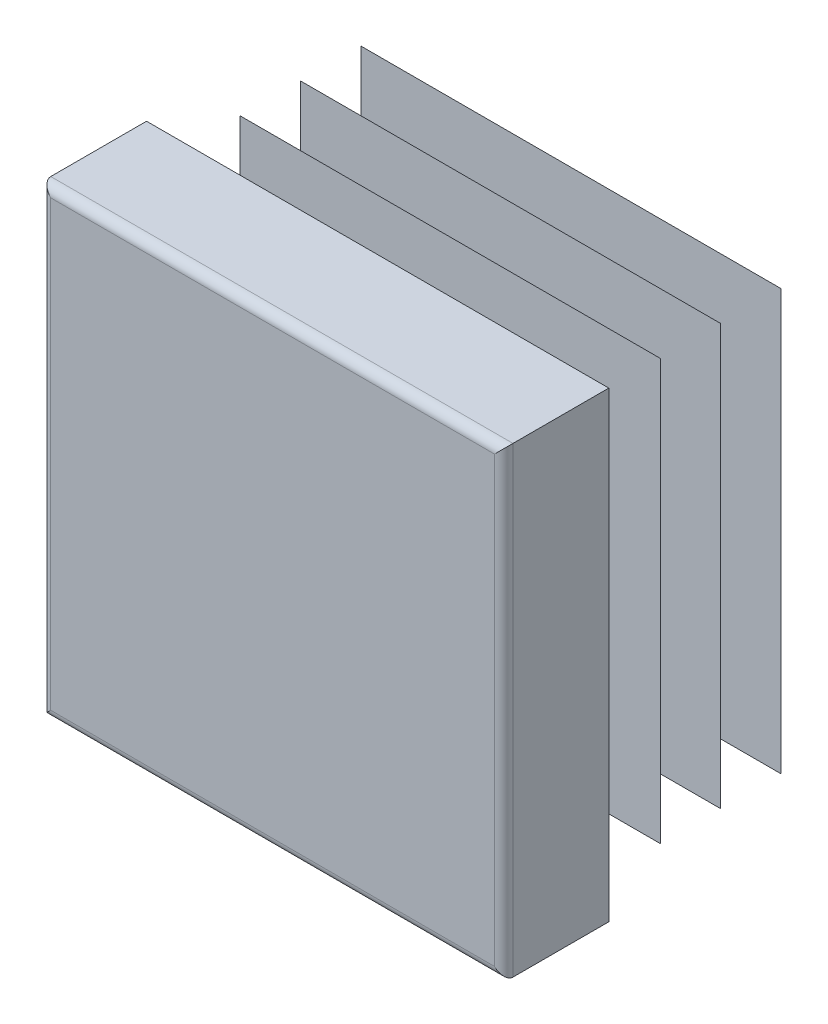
ISO-10303-21;
HEADER;
FILE_DESCRIPTION(('STEP AP214'),'2;1');
FILE_NAME('part.step','',(''),(''),'','','');
FILE_SCHEMA(('AUTOMOTIVE_DESIGN { 1 0 10303 214 1 1 1 1 }'));
ENDSEC;
DATA;
#1=APPLICATION_CONTEXT('core data for automotive mechanical design processes');
#2=APPLICATION_PROTOCOL_DEFINITION('international standard','automotive_design',2000,#1);
#3=PRODUCT_CONTEXT('',#1,'mechanical');
#4=PRODUCT('Part','Part','',(#3));
#5=PRODUCT_RELATED_PRODUCT_CATEGORY('part','',(#4));
#6=PRODUCT_DEFINITION_FORMATION('','',#4);
#7=PRODUCT_DEFINITION_CONTEXT('part definition',#1,'design');
#8=PRODUCT_DEFINITION('design','',#6,#7);
#9=PRODUCT_DEFINITION_SHAPE('','',#8);
#10=(LENGTH_UNIT() NAMED_UNIT(*) SI_UNIT(.MILLI.,.METRE.));
#11=(NAMED_UNIT(*) PLANE_ANGLE_UNIT() SI_UNIT($,.RADIAN.));
#12=(NAMED_UNIT(*) SI_UNIT($,.STERADIAN.) SOLID_ANGLE_UNIT());
#13=UNCERTAINTY_MEASURE_WITH_UNIT(LENGTH_MEASURE(1.E-05),#10,'distance_accuracy_value','');
#14=(GEOMETRIC_REPRESENTATION_CONTEXT(3) GLOBAL_UNCERTAINTY_ASSIGNED_CONTEXT((#13)) GLOBAL_UNIT_ASSIGNED_CONTEXT((#10,
#11,#12)) REPRESENTATION_CONTEXT('',''));
#15=CARTESIAN_POINT('',(0.,0.,0.));
#16=DIRECTION('',(0.,0.,1.));
#17=DIRECTION('',(1.,0.,0.));
#18=AXIS2_PLACEMENT_3D('',#15,#16,#17);
#19=CARTESIAN_POINT('',(10.56,-11.,5.));
#20=DIRECTION('',(0.,0.,-1.));
#21=DIRECTION('',(0.,1.,0.));
#22=AXIS2_PLACEMENT_3D('',#19,#20,#21);
#23=PLANE('',#22);
#24=DIRECTION('',(0.,1.,0.));
#25=VECTOR('',#24,1.);
#26=CARTESIAN_POINT('',(-10.56,-11.,5.));
#27=LINE('',#26,#25);
#28=CARTESIAN_POINT('',(-10.56,-10.56,5.));
#29=VERTEX_POINT('',#28);
#30=CARTESIAN_POINT('',(-10.56,10.56,5.));
#31=VERTEX_POINT('',#30);
#32=EDGE_CURVE('E262',#29,#31,#27,.T.);
#33=ORIENTED_EDGE('',*,*,#32,.F.);
#34=DIRECTION('',(-1.,0.,0.));
#35=VECTOR('',#34,1.);
#36=CARTESIAN_POINT('',(11.,-10.56,5.));
#37=LINE('',#36,#35);
#38=CARTESIAN_POINT('',(10.56,-10.56,5.));
#39=VERTEX_POINT('',#38);
#40=EDGE_CURVE('E432',#39,#29,#37,.T.);
#41=ORIENTED_EDGE('',*,*,#40,.F.);
#42=DIRECTION('',(0.,1.,0.));
#43=VECTOR('',#42,1.);
#44=CARTESIAN_POINT('',(10.56,-11.,5.));
#45=LINE('',#44,#43);
#46=CARTESIAN_POINT('',(10.56,10.56,5.));
#47=VERTEX_POINT('',#46);
#48=EDGE_CURVE('E257',#39,#47,#45,.T.);
#49=ORIENTED_EDGE('',*,*,#48,.T.);
#50=DIRECTION('',(-1.,0.,0.));
#51=VECTOR('',#50,1.);
#52=CARTESIAN_POINT('',(11.,10.56,5.));
#53=LINE('',#52,#51);
#54=EDGE_CURVE('E534',#47,#31,#53,.T.);
#55=ORIENTED_EDGE('',*,*,#54,.T.);
#56=EDGE_LOOP('',(#33,#41,#49,#55));
#57=FACE_BOUND('',#56,.T.);
#58=ADVANCED_FACE('F14',(#57),#23,.F.);
#59=CARTESIAN_POINT('',(-10.56,-11.,4.56));
#60=DIRECTION('',(0.,1.,0.));
#61=DIRECTION('',(-1.,0.,0.));
#62=AXIS2_PLACEMENT_3D('',#59,#60,#61);
#63=CYLINDRICAL_SURFACE('',#62,0.44);
#64=DIRECTION('',(0.,1.,0.));
#65=VECTOR('',#64,1.);
#66=CARTESIAN_POINT('',(-11.,-11.,4.56));
#67=LINE('',#66,#65);
#68=CARTESIAN_POINT('',(-11.,-11.,4.56));
#69=VERTEX_POINT('',#68);
#70=CARTESIAN_POINT('',(-11.,11.,4.56));
#71=VERTEX_POINT('',#70);
#72=EDGE_CURVE('E354',#69,#71,#67,.T.);
#73=ORIENTED_EDGE('',*,*,#72,.F.);
#74=CARTESIAN_POINT('',(-10.56,-10.56,4.56));
#75=DIRECTION('',(-0.707106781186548,0.707106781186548,0.));
#76=DIRECTION('',(0.707106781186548,0.707106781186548,0.));
#77=AXIS2_PLACEMENT_3D('',#74,#75,#76);
#78=ELLIPSE('',#77,0.622253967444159,0.44);
#79=EDGE_CURVE('E59',#69,#29,#78,.T.);
#80=ORIENTED_EDGE('',*,*,#79,.T.);
#81=ORIENTED_EDGE('',*,*,#32,.T.);
#82=CARTESIAN_POINT('',(-10.56,10.56,4.56));
#83=DIRECTION('',(0.707106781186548,0.707106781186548,0.));
#84=DIRECTION('',(-0.707106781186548,0.707106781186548,0.));
#85=AXIS2_PLACEMENT_3D('',#82,#83,#84);
#86=ELLIPSE('',#85,0.62225396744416,0.44);
#87=EDGE_CURVE('E258',#31,#71,#86,.F.);
#88=ORIENTED_EDGE('',*,*,#87,.T.);
#89=EDGE_LOOP('',(#73,#80,#81,#88));
#90=FACE_BOUND('',#89,.T.);
#91=ADVANCED_FACE('F16',(#90),#63,.T.);
#92=CARTESIAN_POINT('',(-11.,-11.,4.56));
#93=DIRECTION('',(1.,0.,0.));
#94=DIRECTION('',(0.,1.,0.));
#95=AXIS2_PLACEMENT_3D('',#92,#93,#94);
#96=PLANE('',#95);
#97=DIRECTION('',(0.,0.,-1.));
#98=VECTOR('',#97,1.);
#99=CARTESIAN_POINT('',(-11.,11.,4.56));
#100=LINE('',#99,#98);
#101=CARTESIAN_POINT('',(-11.,11.,0.));
#102=VERTEX_POINT('',#101);
#103=EDGE_CURVE('E519',#71,#102,#100,.T.);
#104=ORIENTED_EDGE('',*,*,#103,.T.);
#105=DIRECTION('',(0.,1.,0.));
#106=VECTOR('',#105,1.);
#107=CARTESIAN_POINT('',(-11.,-11.,0.));
#108=LINE('',#107,#106);
#109=CARTESIAN_POINT('',(-11.,-11.,0.));
#110=VERTEX_POINT('',#109);
#111=EDGE_CURVE('E352',#110,#102,#108,.T.);
#112=ORIENTED_EDGE('',*,*,#111,.F.);
#113=DIRECTION('',(0.,0.,-1.));
#114=VECTOR('',#113,1.);
#115=CARTESIAN_POINT('',(-11.,-11.,4.56));
#116=LINE('',#115,#114);
#117=EDGE_CURVE('E520',#69,#110,#116,.T.);
#118=ORIENTED_EDGE('',*,*,#117,.F.);
#119=ORIENTED_EDGE('',*,*,#72,.T.);
#120=EDGE_LOOP('',(#104,#112,#118,#119));
#121=FACE_BOUND('',#120,.T.);
#122=ADVANCED_FACE('F604',(#121),#96,.F.);
#123=CARTESIAN_POINT('',(-7.,-11.,0.));
#124=DIRECTION('',(1.,0.,0.));
#125=DIRECTION('',(0.,1.,0.));
#126=AXIS2_PLACEMENT_3D('',#123,#124,#125);
#127=PLANE('',#126);
#128=DIRECTION('',(0.,1.,0.));
#129=VECTOR('',#128,1.);
#130=CARTESIAN_POINT('',(-7.,-11.,0.));
#131=LINE('',#130,#129);
#132=CARTESIAN_POINT('',(-7.,-7.,0.));
#133=VERTEX_POINT('',#132);
#134=CARTESIAN_POINT('',(-7.,7.,0.));
#135=VERTEX_POINT('',#134);
#136=EDGE_CURVE('E349',#133,#135,#131,.T.);
#137=ORIENTED_EDGE('',*,*,#136,.T.);
#138=DIRECTION('',(0.,0.,-1.));
#139=VECTOR('',#138,1.);
#140=CARTESIAN_POINT('',(-7.,7.,0.));
#141=LINE('',#140,#139);
#142=CARTESIAN_POINT('',(-7.,7.,-0.575));
#143=VERTEX_POINT('',#142);
#144=EDGE_CURVE('E445',#135,#143,#141,.T.);
#145=ORIENTED_EDGE('',*,*,#144,.T.);
#146=DIRECTION('',(0.,1.,0.));
#147=VECTOR('',#146,1.);
#148=CARTESIAN_POINT('',(-7.,-11.,-0.575));
#149=LINE('',#148,#147);
#150=CARTESIAN_POINT('',(-7.,-7.,-0.575));
#151=VERTEX_POINT('',#150);
#152=EDGE_CURVE('E346',#151,#143,#149,.T.);
#153=ORIENTED_EDGE('',*,*,#152,.F.);
#154=DIRECTION('',(0.,0.,1.));
#155=VECTOR('',#154,1.);
#156=CARTESIAN_POINT('',(-7.,-7.,0.));
#157=LINE('',#156,#155);
#158=EDGE_CURVE('E439',#151,#133,#157,.T.);
#159=ORIENTED_EDGE('',*,*,#158,.T.);
#160=EDGE_LOOP('',(#137,#145,#153,#159));
#161=FACE_BOUND('',#160,.T.);
#162=ADVANCED_FACE('F728',(#161),#127,.F.);
#163=CARTESIAN_POINT('',(-10.,-11.,-0.575));
#164=DIRECTION('',(0.573576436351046,0.,0.819152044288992));
#165=DIRECTION('',(-0.819152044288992,0.,0.573576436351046));
#166=AXIS2_PLACEMENT_3D('',#163,#164,#165);
#167=PLANE('',#166);
#168=DIRECTION('',(0.,1.,0.));
#169=VECTOR('',#168,1.);
#170=CARTESIAN_POINT('',(-10.,-11.,-0.575));
#171=LINE('',#170,#169);
#172=CARTESIAN_POINT('',(-10.,-10.,-0.575));
#173=VERTEX_POINT('',#172);
#174=CARTESIAN_POINT('',(-10.,10.,-0.575));
#175=VERTEX_POINT('',#174);
#176=EDGE_CURVE('E344',#173,#175,#171,.T.);
#177=ORIENTED_EDGE('',*,*,#176,.T.);
#178=DIRECTION('',(0.633687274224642,-0.633687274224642,-0.443712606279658));
#179=VECTOR('',#178,1.);
#180=CARTESIAN_POINT('',(-1.56724920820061,1.56724920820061,-6.47967567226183));
#181=LINE('',#180,#179);
#182=CARTESIAN_POINT('',(-7.,7.,-2.67562261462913));
#183=VERTEX_POINT('',#182);
#184=EDGE_CURVE('E457',#175,#183,#181,.T.);
#185=ORIENTED_EDGE('',*,*,#184,.T.);
#186=DIRECTION('',(0.,1.,0.));
#187=VECTOR('',#186,1.);
#188=CARTESIAN_POINT('',(-7.,-11.,-2.67562261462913));
#189=LINE('',#188,#187);
#190=CARTESIAN_POINT('',(-7.,-7.,-2.67562261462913));
#191=VERTEX_POINT('',#190);
#192=EDGE_CURVE('E341',#191,#183,#189,.T.);
#193=ORIENTED_EDGE('',*,*,#192,.F.);
#194=DIRECTION('',(-0.633687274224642,-0.633687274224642,0.443712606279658));
#195=VECTOR('',#194,1.);
#196=CARTESIAN_POINT('',(-10.4015595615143,-10.4015595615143,-0.293824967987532));
#197=LINE('',#196,#195);
#198=EDGE_CURVE('E451',#191,#173,#197,.T.);
#199=ORIENTED_EDGE('',*,*,#198,.T.);
#200=EDGE_LOOP('',(#177,#185,#193,#199));
#201=FACE_BOUND('',#200,.T.);
#202=ADVANCED_FACE('F732',(#201),#167,.F.);
#203=CARTESIAN_POINT('',(-7.,-11.,-2.67562261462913));
#204=DIRECTION('',(1.,0.,0.));
#205=DIRECTION('',(0.,1.,0.));
#206=AXIS2_PLACEMENT_3D('',#203,#204,#205);
#207=PLANE('',#206);
#208=ORIENTED_EDGE('',*,*,#192,.T.);
#209=DIRECTION('',(0.,0.,-1.));
#210=VECTOR('',#209,1.);
#211=CARTESIAN_POINT('',(-7.,7.,-2.67562261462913));
#212=LINE('',#211,#210);
#213=CARTESIAN_POINT('',(-7.,7.,-3.45));
#214=VERTEX_POINT('',#213);
#215=EDGE_CURVE('E463',#183,#214,#212,.T.);
#216=ORIENTED_EDGE('',*,*,#215,.T.);
#217=DIRECTION('',(0.,1.,0.));
#218=VECTOR('',#217,1.);
#219=CARTESIAN_POINT('',(-7.,-11.,-3.45));
#220=LINE('',#219,#218);
#221=CARTESIAN_POINT('',(-7.,-7.,-3.45));
#222=VERTEX_POINT('',#221);
#223=EDGE_CURVE('E338',#222,#214,#220,.T.);
#224=ORIENTED_EDGE('',*,*,#223,.F.);
#225=DIRECTION('',(0.,0.,1.));
#226=VECTOR('',#225,1.);
#227=CARTESIAN_POINT('',(-7.,-7.,-2.67562261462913));
#228=LINE('',#227,#226);
#229=EDGE_CURVE('E460',#222,#191,#228,.T.);
#230=ORIENTED_EDGE('',*,*,#229,.T.);
#231=EDGE_LOOP('',(#208,#216,#224,#230));
#232=FACE_BOUND('',#231,.T.);
#233=ADVANCED_FACE('F738',(#232),#207,.F.);
#234=CARTESIAN_POINT('',(-10.,-11.,-3.45));
#235=DIRECTION('',(0.573576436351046,0.,0.819152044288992));
#236=DIRECTION('',(-0.819152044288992,0.,0.573576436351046));
#237=AXIS2_PLACEMENT_3D('',#234,#235,#236);
#238=PLANE('',#237);
#239=DIRECTION('',(0.,1.,0.));
#240=VECTOR('',#239,1.);
#241=CARTESIAN_POINT('',(-10.,-11.,-3.45));
#242=LINE('',#241,#240);
#243=CARTESIAN_POINT('',(-10.,-10.,-3.45));
#244=VERTEX_POINT('',#243);
#245=CARTESIAN_POINT('',(-10.,10.,-3.45));
#246=VERTEX_POINT('',#245);
#247=EDGE_CURVE('E336',#244,#246,#242,.T.);
#248=ORIENTED_EDGE('',*,*,#247,.T.);
#249=DIRECTION('',(0.633687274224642,-0.633687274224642,-0.443712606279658));
#250=VECTOR('',#249,1.);
#251=CARTESIAN_POINT('',(-1.56724920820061,1.5672492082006,-9.35467567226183));
#252=LINE('',#251,#250);
#253=CARTESIAN_POINT('',(-7.,7.,-5.55062261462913));
#254=VERTEX_POINT('',#253);
#255=EDGE_CURVE('E475',#246,#254,#252,.T.);
#256=ORIENTED_EDGE('',*,*,#255,.T.);
#257=DIRECTION('',(0.,1.,0.));
#258=VECTOR('',#257,1.);
#259=CARTESIAN_POINT('',(-7.,-11.,-5.55062261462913));
#260=LINE('',#259,#258);
#261=CARTESIAN_POINT('',(-7.,-7.,-5.55062261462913));
#262=VERTEX_POINT('',#261);
#263=EDGE_CURVE('E333',#262,#254,#260,.T.);
#264=ORIENTED_EDGE('',*,*,#263,.F.);
#265=DIRECTION('',(-0.633687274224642,-0.633687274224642,0.443712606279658));
#266=VECTOR('',#265,1.);
#267=CARTESIAN_POINT('',(-10.4015595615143,-10.4015595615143,-3.16882496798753));
#268=LINE('',#267,#266);
#269=EDGE_CURVE('E469',#262,#244,#268,.T.);
#270=ORIENTED_EDGE('',*,*,#269,.T.);
#271=EDGE_LOOP('',(#248,#256,#264,#270));
#272=FACE_BOUND('',#271,.T.);
#273=ADVANCED_FACE('F742',(#272),#238,.F.);
#274=CARTESIAN_POINT('',(-7.,-11.,-5.55062261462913));
#275=DIRECTION('',(1.,0.,0.));
#276=DIRECTION('',(0.,1.,0.));
#277=AXIS2_PLACEMENT_3D('',#274,#275,#276);
#278=PLANE('',#277);
#279=ORIENTED_EDGE('',*,*,#263,.T.);
#280=DIRECTION('',(0.,0.,-1.));
#281=VECTOR('',#280,1.);
#282=CARTESIAN_POINT('',(-7.,7.,-5.55062261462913));
#283=LINE('',#282,#281);
#284=CARTESIAN_POINT('',(-7.,7.,-6.325));
#285=VERTEX_POINT('',#284);
#286=EDGE_CURVE('E481',#254,#285,#283,.T.);
#287=ORIENTED_EDGE('',*,*,#286,.T.);
#288=DIRECTION('',(0.,1.,0.));
#289=VECTOR('',#288,1.);
#290=CARTESIAN_POINT('',(-7.,-11.,-6.325));
#291=LINE('',#290,#289);
#292=CARTESIAN_POINT('',(-7.,-7.,-6.325));
#293=VERTEX_POINT('',#292);
#294=EDGE_CURVE('E330',#293,#285,#291,.T.);
#295=ORIENTED_EDGE('',*,*,#294,.F.);
#296=DIRECTION('',(0.,0.,1.));
#297=VECTOR('',#296,1.);
#298=CARTESIAN_POINT('',(-7.,-7.,-5.55062261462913));
#299=LINE('',#298,#297);
#300=EDGE_CURVE('E478',#293,#262,#299,.T.);
#301=ORIENTED_EDGE('',*,*,#300,.T.);
#302=EDGE_LOOP('',(#279,#287,#295,#301));
#303=FACE_BOUND('',#302,.T.);
#304=ADVANCED_FACE('F746',(#303),#278,.F.);
#305=CARTESIAN_POINT('',(-10.,-11.,-6.325));
#306=DIRECTION('',(0.573576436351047,0.,0.819152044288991));
#307=DIRECTION('',(-0.819152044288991,0.,0.573576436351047));
#308=AXIS2_PLACEMENT_3D('',#305,#306,#307);
#309=PLANE('',#308);
#310=DIRECTION('',(0.,1.,0.));
#311=VECTOR('',#310,1.);
#312=CARTESIAN_POINT('',(-10.,-11.,-6.325));
#313=LINE('',#312,#311);
#314=CARTESIAN_POINT('',(-10.,-10.,-6.325));
#315=VERTEX_POINT('',#314);
#316=CARTESIAN_POINT('',(-10.,10.,-6.325));
#317=VERTEX_POINT('',#316);
#318=EDGE_CURVE('E328',#315,#317,#313,.T.);
#319=ORIENTED_EDGE('',*,*,#318,.T.);
#320=DIRECTION('',(0.633687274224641,-0.633687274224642,-0.443712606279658));
#321=VECTOR('',#320,1.);
#322=CARTESIAN_POINT('',(-1.56724920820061,1.5672492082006,-12.2296756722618));
#323=LINE('',#322,#321);
#324=CARTESIAN_POINT('',(-7.,7.,-8.42562261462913));
#325=VERTEX_POINT('',#324);
#326=EDGE_CURVE('E493',#317,#325,#323,.T.);
#327=ORIENTED_EDGE('',*,*,#326,.T.);
#328=DIRECTION('',(0.,1.,0.));
#329=VECTOR('',#328,1.);
#330=CARTESIAN_POINT('',(-7.,-11.,-8.42562261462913));
#331=LINE('',#330,#329);
#332=CARTESIAN_POINT('',(-7.,-7.,-8.42562261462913));
#333=VERTEX_POINT('',#332);
#334=EDGE_CURVE('E325',#333,#325,#331,.T.);
#335=ORIENTED_EDGE('',*,*,#334,.F.);
#336=DIRECTION('',(-0.633687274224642,-0.633687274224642,0.443712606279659));
#337=VECTOR('',#336,1.);
#338=CARTESIAN_POINT('',(-10.4015595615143,-10.4015595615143,-6.04382496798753));
#339=LINE('',#338,#337);
#340=EDGE_CURVE('E487',#333,#315,#339,.T.);
#341=ORIENTED_EDGE('',*,*,#340,.T.);
#342=EDGE_LOOP('',(#319,#327,#335,#341));
#343=FACE_BOUND('',#342,.T.);
#344=ADVANCED_FACE('F668',(#343),#309,.F.);
#345=CARTESIAN_POINT('',(-7.,-11.,-8.42562261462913));
#346=DIRECTION('',(1.,0.,0.));
#347=DIRECTION('',(0.,1.,0.));
#348=AXIS2_PLACEMENT_3D('',#345,#346,#347);
#349=PLANE('',#348);
#350=ORIENTED_EDGE('',*,*,#334,.T.);
#351=DIRECTION('',(0.,0.,-1.));
#352=VECTOR('',#351,1.);
#353=CARTESIAN_POINT('',(-7.,7.,-8.42562261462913));
#354=LINE('',#353,#352);
#355=CARTESIAN_POINT('',(-7.,7.,-9.2));
#356=VERTEX_POINT('',#355);
#357=EDGE_CURVE('E499',#325,#356,#354,.T.);
#358=ORIENTED_EDGE('',*,*,#357,.T.);
#359=DIRECTION('',(0.,1.,0.));
#360=VECTOR('',#359,1.);
#361=CARTESIAN_POINT('',(-7.,-11.,-9.2));
#362=LINE('',#361,#360);
#363=CARTESIAN_POINT('',(-7.,-7.,-9.2));
#364=VERTEX_POINT('',#363);
#365=EDGE_CURVE('E322',#364,#356,#362,.T.);
#366=ORIENTED_EDGE('',*,*,#365,.F.);
#367=DIRECTION('',(0.,0.,1.));
#368=VECTOR('',#367,1.);
#369=CARTESIAN_POINT('',(-7.,-7.,-8.42562261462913));
#370=LINE('',#369,#368);
#371=EDGE_CURVE('E496',#364,#333,#370,.T.);
#372=ORIENTED_EDGE('',*,*,#371,.T.);
#373=EDGE_LOOP('',(#350,#358,#366,#372));
#374=FACE_BOUND('',#373,.T.);
#375=ADVANCED_FACE('F665',(#374),#349,.F.);
#376=CARTESIAN_POINT('',(-10.,-11.,-9.2));
#377=DIRECTION('',(0.573576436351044,0.,0.819152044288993));
#378=DIRECTION('',(-0.819152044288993,0.,0.573576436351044));
#379=AXIS2_PLACEMENT_3D('',#376,#377,#378);
#380=PLANE('',#379);
#381=DIRECTION('',(0.,1.,0.));
#382=VECTOR('',#381,1.);
#383=CARTESIAN_POINT('',(-10.,-11.,-9.2));
#384=LINE('',#383,#382);
#385=CARTESIAN_POINT('',(-10.,-10.,-9.2));
#386=VERTEX_POINT('',#385);
#387=CARTESIAN_POINT('',(-10.,10.,-9.2));
#388=VERTEX_POINT('',#387);
#389=EDGE_CURVE('E320',#386,#388,#384,.T.);
#390=ORIENTED_EDGE('',*,*,#389,.T.);
#391=DIRECTION('',(0.633687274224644,-0.633687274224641,-0.443712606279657));
#392=VECTOR('',#391,1.);
#393=CARTESIAN_POINT('',(-1.5672492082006,1.56724920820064,-15.1046756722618));
#394=LINE('',#393,#392);
#395=CARTESIAN_POINT('',(-7.,7.,-11.3006226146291));
#396=VERTEX_POINT('',#395);
#397=EDGE_CURVE('E511',#388,#396,#394,.T.);
#398=ORIENTED_EDGE('',*,*,#397,.T.);
#399=DIRECTION('',(0.,1.,0.));
#400=VECTOR('',#399,1.);
#401=CARTESIAN_POINT('',(-7.,-11.,-11.3006226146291));
#402=LINE('',#401,#400);
#403=CARTESIAN_POINT('',(-7.,-7.,-11.3006226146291));
#404=VERTEX_POINT('',#403);
#405=EDGE_CURVE('E317',#404,#396,#402,.T.);
#406=ORIENTED_EDGE('',*,*,#405,.F.);
#407=DIRECTION('',(-0.633687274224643,-0.633687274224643,0.443712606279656));
#408=VECTOR('',#407,1.);
#409=CARTESIAN_POINT('',(-10.4015595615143,-10.4015595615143,-8.91882496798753));
#410=LINE('',#409,#408);
#411=EDGE_CURVE('E505',#404,#386,#410,.T.);
#412=ORIENTED_EDGE('',*,*,#411,.T.);
#413=EDGE_LOOP('',(#390,#398,#406,#412));
#414=FACE_BOUND('',#413,.T.);
#415=ADVANCED_FACE('F580',(#414),#380,.F.);
#416=CARTESIAN_POINT('',(-7.,-11.,-11.3006226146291));
#417=DIRECTION('',(1.,0.,0.));
#418=DIRECTION('',(0.,1.,0.));
#419=AXIS2_PLACEMENT_3D('',#416,#417,#418);
#420=PLANE('',#419);
#421=ORIENTED_EDGE('',*,*,#405,.T.);
#422=DIRECTION('',(0.,0.,-1.));
#423=VECTOR('',#422,1.);
#424=CARTESIAN_POINT('',(-7.,7.,-11.3006226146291));
#425=LINE('',#424,#423);
#426=CARTESIAN_POINT('',(-7.,7.,-11.5));
#427=VERTEX_POINT('',#426);
#428=EDGE_CURVE('E517',#396,#427,#425,.T.);
#429=ORIENTED_EDGE('',*,*,#428,.T.);
#430=DIRECTION('',(0.,1.,0.));
#431=VECTOR('',#430,1.);
#432=CARTESIAN_POINT('',(-7.,-11.,-11.5));
#433=LINE('',#432,#431);
#434=CARTESIAN_POINT('',(-7.,-7.,-11.5));
#435=VERTEX_POINT('',#434);
#436=EDGE_CURVE('E314',#435,#427,#433,.T.);
#437=ORIENTED_EDGE('',*,*,#436,.F.);
#438=DIRECTION('',(0.,0.,1.));
#439=VECTOR('',#438,1.);
#440=CARTESIAN_POINT('',(-7.,-7.,-11.3006226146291));
#441=LINE('',#440,#439);
#442=EDGE_CURVE('E514',#435,#404,#441,.T.);
#443=ORIENTED_EDGE('',*,*,#442,.T.);
#444=EDGE_LOOP('',(#421,#429,#437,#443));
#445=FACE_BOUND('',#444,.T.);
#446=ADVANCED_FACE('F582',(#445),#420,.F.);
#447=CARTESIAN_POINT('',(-7.,-11.,-11.5));
#448=DIRECTION('',(0.,0.,1.));
#449=DIRECTION('',(0.,-1.,0.));
#450=AXIS2_PLACEMENT_3D('',#447,#448,#449);
#451=PLANE('',#450);
#452=ORIENTED_EDGE('',*,*,#436,.T.);
#453=DIRECTION('',(-1.,0.,0.));
#454=VECTOR('',#453,1.);
#455=CARTESIAN_POINT('',(11.,7.,-11.5));
#456=LINE('',#455,#454);
#457=CARTESIAN_POINT('',(7.,7.,-11.5));
#458=VERTEX_POINT('',#457);
#459=EDGE_CURVE('E388',#458,#427,#456,.T.);
#460=ORIENTED_EDGE('',*,*,#459,.F.);
#461=DIRECTION('',(0.,1.,0.));
#462=VECTOR('',#461,1.);
#463=CARTESIAN_POINT('',(7.,-11.,-11.5));
#464=LINE('',#463,#462);
#465=CARTESIAN_POINT('',(7.,-7.,-11.5));
#466=VERTEX_POINT('',#465);
#467=EDGE_CURVE('E311',#466,#458,#464,.T.);
#468=ORIENTED_EDGE('',*,*,#467,.F.);
#469=DIRECTION('',(-1.,0.,0.));
#470=VECTOR('',#469,1.);
#471=CARTESIAN_POINT('',(11.,-7.,-11.5));
#472=LINE('',#471,#470);
#473=EDGE_CURVE('E386',#466,#435,#472,.T.);
#474=ORIENTED_EDGE('',*,*,#473,.T.);
#475=EDGE_LOOP('',(#452,#460,#468,#474));
#476=FACE_BOUND('',#475,.T.);
#477=ADVANCED_FACE('F385',(#476),#451,.F.);
#478=CARTESIAN_POINT('',(7.,-11.,-11.5));
#479=DIRECTION('',(-1.,0.,0.));
#480=DIRECTION('',(0.,-1.,0.));
#481=AXIS2_PLACEMENT_3D('',#478,#479,#480);
#482=PLANE('',#481);
#483=ORIENTED_EDGE('',*,*,#467,.T.);
#484=DIRECTION('',(0.,0.,1.));
#485=VECTOR('',#484,1.);
#486=CARTESIAN_POINT('',(7.,7.,-11.5));
#487=LINE('',#486,#485);
#488=CARTESIAN_POINT('',(7.,7.,-11.3006226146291));
#489=VERTEX_POINT('',#488);
#490=EDGE_CURVE('E9',#458,#489,#487,.T.);
#491=ORIENTED_EDGE('',*,*,#490,.T.);
#492=DIRECTION('',(0.,1.,0.));
#493=VECTOR('',#492,1.);
#494=CARTESIAN_POINT('',(7.,-11.,-11.3006226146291));
#495=LINE('',#494,#493);
#496=CARTESIAN_POINT('',(7.,-7.,-11.3006226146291));
#497=VERTEX_POINT('',#496);
#498=EDGE_CURVE('E308',#497,#489,#495,.T.);
#499=ORIENTED_EDGE('',*,*,#498,.F.);
#500=DIRECTION('',(0.,0.,-1.));
#501=VECTOR('',#500,1.);
#502=CARTESIAN_POINT('',(7.,-7.,-11.5));
#503=LINE('',#502,#501);
#504=EDGE_CURVE('E23',#497,#466,#503,.T.);
#505=ORIENTED_EDGE('',*,*,#504,.T.);
#506=EDGE_LOOP('',(#483,#491,#499,#505));
#507=FACE_BOUND('',#506,.T.);
#508=ADVANCED_FACE('F378',(#507),#482,.F.);
#509=CARTESIAN_POINT('',(7.,-11.,-11.3006226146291));
#510=DIRECTION('',(-0.573576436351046,0.,0.819152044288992));
#511=DIRECTION('',(-0.819152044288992,0.,-0.573576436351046));
#512=AXIS2_PLACEMENT_3D('',#509,#510,#511);
#513=PLANE('',#512);
#514=ORIENTED_EDGE('',*,*,#498,.T.);
#515=DIRECTION('',(0.633687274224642,0.633687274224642,0.443712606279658));
#516=VECTOR('',#515,1.);
#517=CARTESIAN_POINT('',(-0.22807210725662,-0.228072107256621,-16.3617731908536));
#518=LINE('',#517,#516);
#519=CARTESIAN_POINT('',(10.,10.,-9.2));
#520=VERTEX_POINT('',#519);
#521=EDGE_CURVE('E508',#489,#520,#518,.T.);
#522=ORIENTED_EDGE('',*,*,#521,.T.);
#523=DIRECTION('',(0.,1.,0.));
#524=VECTOR('',#523,1.);
#525=CARTESIAN_POINT('',(10.,-11.,-9.2));
#526=LINE('',#525,#524);
#527=CARTESIAN_POINT('',(10.,-10.,-9.2));
#528=VERTEX_POINT('',#527);
#529=EDGE_CURVE('E305',#528,#520,#526,.T.);
#530=ORIENTED_EDGE('',*,*,#529,.F.);
#531=DIRECTION('',(-0.633687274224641,0.633687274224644,-0.443712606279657));
#532=VECTOR('',#531,1.);
#533=CARTESIAN_POINT('',(8.60623824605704,-8.60623824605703,-10.1759224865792));
#534=LINE('',#533,#532);
#535=EDGE_CURVE('E502',#528,#497,#534,.T.);
#536=ORIENTED_EDGE('',*,*,#535,.T.);
#537=EDGE_LOOP('',(#514,#522,#530,#536));
#538=FACE_BOUND('',#537,.T.);
#539=ADVANCED_FACE('F588',(#538),#513,.F.);
#540=CARTESIAN_POINT('',(10.,-11.,-9.2));
#541=DIRECTION('',(0.,0.,-1.));
#542=DIRECTION('',(0.,1.,0.));
#543=AXIS2_PLACEMENT_3D('',#540,#541,#542);
#544=PLANE('',#543);
#545=ORIENTED_EDGE('',*,*,#529,.T.);
#546=DIRECTION('',(-1.,0.,0.));
#547=VECTOR('',#546,1.);
#548=CARTESIAN_POINT('',(11.,10.,-9.2));
#549=LINE('',#548,#547);
#550=EDGE_CURVE('E394',#520,#388,#549,.T.);
#551=ORIENTED_EDGE('',*,*,#550,.T.);
#552=ORIENTED_EDGE('',*,*,#389,.F.);
#553=DIRECTION('',(-1.,0.,0.));
#554=VECTOR('',#553,1.);
#555=CARTESIAN_POINT('',(11.,-10.,-9.2));
#556=LINE('',#555,#554);
#557=EDGE_CURVE('E401',#528,#386,#556,.T.);
#558=ORIENTED_EDGE('',*,*,#557,.F.);
#559=EDGE_LOOP('',(#545,#551,#552,#558));
#560=FACE_BOUND('',#559,.T.);
#561=ORIENTED_EDGE('',*,*,#365,.T.);
#562=DIRECTION('',(-1.,0.,0.));
#563=VECTOR('',#562,1.);
#564=CARTESIAN_POINT('',(11.,7.,-9.2));
#565=LINE('',#564,#563);
#566=CARTESIAN_POINT('',(7.,7.,-9.2));
#567=VERTEX_POINT('',#566);
#568=EDGE_CURVE('E567',#567,#356,#565,.T.);
#569=ORIENTED_EDGE('',*,*,#568,.F.);
#570=DIRECTION('',(0.,1.,0.));
#571=VECTOR('',#570,1.);
#572=CARTESIAN_POINT('',(7.,-11.,-9.2));
#573=LINE('',#572,#571);
#574=CARTESIAN_POINT('',(7.,-7.,-9.2));
#575=VERTEX_POINT('',#574);
#576=EDGE_CURVE('E302',#575,#567,#573,.T.);
#577=ORIENTED_EDGE('',*,*,#576,.F.);
#578=DIRECTION('',(-1.,0.,0.));
#579=VECTOR('',#578,1.);
#580=CARTESIAN_POINT('',(11.,-7.,-9.2));
#581=LINE('',#580,#579);
#582=EDGE_CURVE('E403',#575,#364,#581,.T.);
#583=ORIENTED_EDGE('',*,*,#582,.T.);
#584=EDGE_LOOP('',(#561,#569,#577,#583));
#585=FACE_BOUND('',#584,.T.);
#586=ADVANCED_FACE('F571',(#560,#585),#544,.F.);
#587=CARTESIAN_POINT('',(7.,-11.,-9.2));
#588=DIRECTION('',(-1.,0.,0.));
#589=DIRECTION('',(0.,-1.,0.));
#590=AXIS2_PLACEMENT_3D('',#587,#588,#589);
#591=PLANE('',#590);
#592=ORIENTED_EDGE('',*,*,#576,.T.);
#593=DIRECTION('',(0.,0.,1.));
#594=VECTOR('',#593,1.);
#595=CARTESIAN_POINT('',(7.,7.,-9.2));
#596=LINE('',#595,#594);
#597=CARTESIAN_POINT('',(7.,7.,-8.42562261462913));
#598=VERTEX_POINT('',#597);
#599=EDGE_CURVE('E372',#567,#598,#596,.T.);
#600=ORIENTED_EDGE('',*,*,#599,.T.);
#601=DIRECTION('',(0.,1.,0.));
#602=VECTOR('',#601,1.);
#603=CARTESIAN_POINT('',(7.,-11.,-8.42562261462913));
#604=LINE('',#603,#602);
#605=CARTESIAN_POINT('',(7.,-7.,-8.42562261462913));
#606=VERTEX_POINT('',#605);
#607=EDGE_CURVE('E299',#606,#598,#604,.T.);
#608=ORIENTED_EDGE('',*,*,#607,.F.);
#609=DIRECTION('',(0.,0.,-1.));
#610=VECTOR('',#609,1.);
#611=CARTESIAN_POINT('',(7.,-7.,-9.2));
#612=LINE('',#611,#610);
#613=EDGE_CURVE('E369',#606,#575,#612,.T.);
#614=ORIENTED_EDGE('',*,*,#613,.T.);
#615=EDGE_LOOP('',(#592,#600,#608,#614));
#616=FACE_BOUND('',#615,.T.);
#617=ADVANCED_FACE('F596',(#616),#591,.F.);
#618=CARTESIAN_POINT('',(7.,-11.,-8.42562261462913));
#619=DIRECTION('',(-0.573576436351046,0.,0.819152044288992));
#620=DIRECTION('',(-0.819152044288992,0.,-0.573576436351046));
#621=AXIS2_PLACEMENT_3D('',#618,#619,#620);
#622=PLANE('',#621);
#623=ORIENTED_EDGE('',*,*,#607,.T.);
#624=DIRECTION('',(0.633687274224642,0.633687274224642,0.443712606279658));
#625=VECTOR('',#624,1.);
#626=CARTESIAN_POINT('',(-0.228072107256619,-0.228072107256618,-13.4867731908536));
#627=LINE('',#626,#625);
#628=CARTESIAN_POINT('',(10.,10.,-6.325));
#629=VERTEX_POINT('',#628);
#630=EDGE_CURVE('E490',#598,#629,#627,.T.);
#631=ORIENTED_EDGE('',*,*,#630,.T.);
#632=DIRECTION('',(0.,1.,0.));
#633=VECTOR('',#632,1.);
#634=CARTESIAN_POINT('',(10.,-11.,-6.325));
#635=LINE('',#634,#633);
#636=CARTESIAN_POINT('',(10.,-10.,-6.325));
#637=VERTEX_POINT('',#636);
#638=EDGE_CURVE('E296',#637,#629,#635,.T.);
#639=ORIENTED_EDGE('',*,*,#638,.F.);
#640=DIRECTION('',(-0.633687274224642,0.633687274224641,-0.443712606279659));
#641=VECTOR('',#640,1.);
#642=CARTESIAN_POINT('',(8.60623824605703,-8.60623824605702,-7.30092248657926));
#643=LINE('',#642,#641);
#644=EDGE_CURVE('E484',#637,#606,#643,.T.);
#645=ORIENTED_EDGE('',*,*,#644,.T.);
#646=EDGE_LOOP('',(#623,#631,#639,#645));
#647=FACE_BOUND('',#646,.T.);
#648=ADVANCED_FACE('F648',(#647),#622,.F.);
#649=CARTESIAN_POINT('',(10.,-11.,-6.325));
#650=DIRECTION('',(0.,0.,-1.));
#651=DIRECTION('',(0.,1.,0.));
#652=AXIS2_PLACEMENT_3D('',#649,#650,#651);
#653=PLANE('',#652);
#654=ORIENTED_EDGE('',*,*,#638,.T.);
#655=DIRECTION('',(-1.,0.,0.));
#656=VECTOR('',#655,1.);
#657=CARTESIAN_POINT('',(11.,10.,-6.325));
#658=LINE('',#657,#656);
#659=EDGE_CURVE('E561',#629,#317,#658,.T.);
#660=ORIENTED_EDGE('',*,*,#659,.T.);
#661=ORIENTED_EDGE('',*,*,#318,.F.);
#662=DIRECTION('',(-1.,0.,0.));
#663=VECTOR('',#662,1.);
#664=CARTESIAN_POINT('',(11.,-10.,-6.325));
#665=LINE('',#664,#663);
#666=EDGE_CURVE('E409',#637,#315,#665,.T.);
#667=ORIENTED_EDGE('',*,*,#666,.F.);
#668=EDGE_LOOP('',(#654,#660,#661,#667));
#669=FACE_BOUND('',#668,.T.);
#670=ORIENTED_EDGE('',*,*,#294,.T.);
#671=DIRECTION('',(-1.,0.,0.));
#672=VECTOR('',#671,1.);
#673=CARTESIAN_POINT('',(11.,7.,-6.325));
#674=LINE('',#673,#672);
#675=CARTESIAN_POINT('',(7.,7.,-6.325));
#676=VERTEX_POINT('',#675);
#677=EDGE_CURVE('E559',#676,#285,#674,.T.);
#678=ORIENTED_EDGE('',*,*,#677,.F.);
#679=DIRECTION('',(0.,1.,0.));
#680=VECTOR('',#679,1.);
#681=CARTESIAN_POINT('',(7.,-11.,-6.325));
#682=LINE('',#681,#680);
#683=CARTESIAN_POINT('',(7.,-7.,-6.325));
#684=VERTEX_POINT('',#683);
#685=EDGE_CURVE('E293',#684,#676,#682,.T.);
#686=ORIENTED_EDGE('',*,*,#685,.F.);
#687=DIRECTION('',(-1.,0.,0.));
#688=VECTOR('',#687,1.);
#689=CARTESIAN_POINT('',(11.,-7.,-6.325));
#690=LINE('',#689,#688);
#691=EDGE_CURVE('E411',#684,#293,#690,.T.);
#692=ORIENTED_EDGE('',*,*,#691,.T.);
#693=EDGE_LOOP('',(#670,#678,#686,#692));
#694=FACE_BOUND('',#693,.T.);
#695=ADVANCED_FACE('F644',(#669,#694),#653,.F.);
#696=CARTESIAN_POINT('',(7.,-11.,-6.325));
#697=DIRECTION('',(-1.,0.,0.));
#698=DIRECTION('',(0.,-1.,0.));
#699=AXIS2_PLACEMENT_3D('',#696,#697,#698);
#700=PLANE('',#699);
#701=ORIENTED_EDGE('',*,*,#685,.T.);
#702=DIRECTION('',(0.,0.,1.));
#703=VECTOR('',#702,1.);
#704=CARTESIAN_POINT('',(7.,7.,-6.325));
#705=LINE('',#704,#703);
#706=CARTESIAN_POINT('',(7.,7.,-5.55062261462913));
#707=VERTEX_POINT('',#706);
#708=EDGE_CURVE('E366',#676,#707,#705,.T.);
#709=ORIENTED_EDGE('',*,*,#708,.T.);
#710=DIRECTION('',(0.,1.,0.));
#711=VECTOR('',#710,1.);
#712=CARTESIAN_POINT('',(7.,-11.,-5.55062261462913));
#713=LINE('',#712,#711);
#714=CARTESIAN_POINT('',(7.,-7.,-5.55062261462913));
#715=VERTEX_POINT('',#714);
#716=EDGE_CURVE('E290',#715,#707,#713,.T.);
#717=ORIENTED_EDGE('',*,*,#716,.F.);
#718=DIRECTION('',(0.,0.,-1.));
#719=VECTOR('',#718,1.);
#720=CARTESIAN_POINT('',(7.,-7.,-6.325));
#721=LINE('',#720,#719);
#722=EDGE_CURVE('E363',#715,#684,#721,.T.);
#723=ORIENTED_EDGE('',*,*,#722,.T.);
#724=EDGE_LOOP('',(#701,#709,#717,#723));
#725=FACE_BOUND('',#724,.T.);
#726=ADVANCED_FACE('F640',(#725),#700,.F.);
#727=CARTESIAN_POINT('',(7.,-11.,-5.55062261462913));
#728=DIRECTION('',(-0.573576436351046,0.,0.819152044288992));
#729=DIRECTION('',(-0.819152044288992,0.,-0.573576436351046));
#730=AXIS2_PLACEMENT_3D('',#727,#728,#729);
#731=PLANE('',#730);
#732=ORIENTED_EDGE('',*,*,#716,.T.);
#733=DIRECTION('',(0.633687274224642,0.633687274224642,0.443712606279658));
#734=VECTOR('',#733,1.);
#735=CARTESIAN_POINT('',(-0.228072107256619,-0.228072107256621,-10.6117731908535));
#736=LINE('',#735,#734);
#737=CARTESIAN_POINT('',(10.,10.,-3.45));
#738=VERTEX_POINT('',#737);
#739=EDGE_CURVE('E472',#707,#738,#736,.T.);
#740=ORIENTED_EDGE('',*,*,#739,.T.);
#741=DIRECTION('',(0.,1.,0.));
#742=VECTOR('',#741,1.);
#743=CARTESIAN_POINT('',(10.,-11.,-3.45));
#744=LINE('',#743,#742);
#745=CARTESIAN_POINT('',(10.,-10.,-3.45));
#746=VERTEX_POINT('',#745);
#747=EDGE_CURVE('E287',#746,#738,#744,.T.);
#748=ORIENTED_EDGE('',*,*,#747,.F.);
#749=DIRECTION('',(-0.633687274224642,0.633687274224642,-0.443712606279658));
#750=VECTOR('',#749,1.);
#751=CARTESIAN_POINT('',(8.60623824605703,-8.60623824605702,-4.42592248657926));
#752=LINE('',#751,#750);
#753=EDGE_CURVE('E466',#746,#715,#752,.T.);
#754=ORIENTED_EDGE('',*,*,#753,.T.);
#755=EDGE_LOOP('',(#732,#740,#748,#754));
#756=FACE_BOUND('',#755,.T.);
#757=ADVANCED_FACE('F636',(#756),#731,.F.);
#758=CARTESIAN_POINT('',(10.,-11.,-3.45));
#759=DIRECTION('',(0.,0.,-1.));
#760=DIRECTION('',(0.,1.,0.));
#761=AXIS2_PLACEMENT_3D('',#758,#759,#760);
#762=PLANE('',#761);
#763=ORIENTED_EDGE('',*,*,#747,.T.);
#764=DIRECTION('',(-1.,0.,0.));
#765=VECTOR('',#764,1.);
#766=CARTESIAN_POINT('',(11.,10.,-3.45));
#767=LINE('',#766,#765);
#768=EDGE_CURVE('E553',#738,#246,#767,.T.);
#769=ORIENTED_EDGE('',*,*,#768,.T.);
#770=ORIENTED_EDGE('',*,*,#247,.F.);
#771=DIRECTION('',(-1.,0.,0.));
#772=VECTOR('',#771,1.);
#773=CARTESIAN_POINT('',(11.,-10.,-3.45));
#774=LINE('',#773,#772);
#775=EDGE_CURVE('E417',#746,#244,#774,.T.);
#776=ORIENTED_EDGE('',*,*,#775,.F.);
#777=EDGE_LOOP('',(#763,#769,#770,#776));
#778=FACE_BOUND('',#777,.T.);
#779=ORIENTED_EDGE('',*,*,#223,.T.);
#780=DIRECTION('',(-1.,0.,0.));
#781=VECTOR('',#780,1.);
#782=CARTESIAN_POINT('',(11.,7.,-3.45));
#783=LINE('',#782,#781);
#784=CARTESIAN_POINT('',(7.,7.,-3.45));
#785=VERTEX_POINT('',#784);
#786=EDGE_CURVE('E551',#785,#214,#783,.T.);
#787=ORIENTED_EDGE('',*,*,#786,.F.);
#788=DIRECTION('',(0.,1.,0.));
#789=VECTOR('',#788,1.);
#790=CARTESIAN_POINT('',(7.,-11.,-3.45));
#791=LINE('',#790,#789);
#792=CARTESIAN_POINT('',(7.,-7.,-3.45));
#793=VERTEX_POINT('',#792);
#794=EDGE_CURVE('E284',#793,#785,#791,.T.);
#795=ORIENTED_EDGE('',*,*,#794,.F.);
#796=DIRECTION('',(-1.,0.,0.));
#797=VECTOR('',#796,1.);
#798=CARTESIAN_POINT('',(11.,-7.,-3.45));
#799=LINE('',#798,#797);
#800=EDGE_CURVE('E419',#793,#222,#799,.T.);
#801=ORIENTED_EDGE('',*,*,#800,.T.);
#802=EDGE_LOOP('',(#779,#787,#795,#801));
#803=FACE_BOUND('',#802,.T.);
#804=ADVANCED_FACE('F632',(#778,#803),#762,.F.);
#805=CARTESIAN_POINT('',(7.,-11.,-3.45));
#806=DIRECTION('',(-1.,0.,0.));
#807=DIRECTION('',(0.,-1.,0.));
#808=AXIS2_PLACEMENT_3D('',#805,#806,#807);
#809=PLANE('',#808);
#810=ORIENTED_EDGE('',*,*,#794,.T.);
#811=DIRECTION('',(0.,0.,1.));
#812=VECTOR('',#811,1.);
#813=CARTESIAN_POINT('',(7.,7.,-3.45));
#814=LINE('',#813,#812);
#815=CARTESIAN_POINT('',(7.,7.,-2.67562261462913));
#816=VERTEX_POINT('',#815);
#817=EDGE_CURVE('E360',#785,#816,#814,.T.);
#818=ORIENTED_EDGE('',*,*,#817,.T.);
#819=DIRECTION('',(0.,1.,0.));
#820=VECTOR('',#819,1.);
#821=CARTESIAN_POINT('',(7.,-11.,-2.67562261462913));
#822=LINE('',#821,#820);
#823=CARTESIAN_POINT('',(7.,-7.,-2.67562261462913));
#824=VERTEX_POINT('',#823);
#825=EDGE_CURVE('E281',#824,#816,#822,.T.);
#826=ORIENTED_EDGE('',*,*,#825,.F.);
#827=DIRECTION('',(0.,0.,-1.));
#828=VECTOR('',#827,1.);
#829=CARTESIAN_POINT('',(7.,-7.,-3.45));
#830=LINE('',#829,#828);
#831=EDGE_CURVE('E357',#824,#793,#830,.T.);
#832=ORIENTED_EDGE('',*,*,#831,.T.);
#833=EDGE_LOOP('',(#810,#818,#826,#832));
#834=FACE_BOUND('',#833,.T.);
#835=ADVANCED_FACE('F628',(#834),#809,.F.);
#836=CARTESIAN_POINT('',(7.,-11.,-2.67562261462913));
#837=DIRECTION('',(-0.573576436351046,0.,0.819152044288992));
#838=DIRECTION('',(-0.819152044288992,0.,-0.573576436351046));
#839=AXIS2_PLACEMENT_3D('',#836,#837,#838);
#840=PLANE('',#839);
#841=ORIENTED_EDGE('',*,*,#825,.T.);
#842=DIRECTION('',(0.633687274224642,0.633687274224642,0.443712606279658));
#843=VECTOR('',#842,1.);
#844=CARTESIAN_POINT('',(-0.228072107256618,-0.228072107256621,-7.73677319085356));
#845=LINE('',#844,#843);
#846=CARTESIAN_POINT('',(10.,10.,-0.575));
#847=VERTEX_POINT('',#846);
#848=EDGE_CURVE('E454',#816,#847,#845,.T.);
#849=ORIENTED_EDGE('',*,*,#848,.T.);
#850=DIRECTION('',(0.,1.,0.));
#851=VECTOR('',#850,1.);
#852=CARTESIAN_POINT('',(10.,-11.,-0.575));
#853=LINE('',#852,#851);
#854=CARTESIAN_POINT('',(10.,-10.,-0.575));
#855=VERTEX_POINT('',#854);
#856=EDGE_CURVE('E278',#855,#847,#853,.T.);
#857=ORIENTED_EDGE('',*,*,#856,.F.);
#858=DIRECTION('',(-0.633687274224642,0.633687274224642,-0.443712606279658));
#859=VECTOR('',#858,1.);
#860=CARTESIAN_POINT('',(8.60623824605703,-8.60623824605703,-1.55092248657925));
#861=LINE('',#860,#859);
#862=EDGE_CURVE('E448',#855,#824,#861,.T.);
#863=ORIENTED_EDGE('',*,*,#862,.T.);
#864=EDGE_LOOP('',(#841,#849,#857,#863));
#865=FACE_BOUND('',#864,.T.);
#866=ADVANCED_FACE('F624',(#865),#840,.F.);
#867=CARTESIAN_POINT('',(10.,-11.,-0.575));
#868=DIRECTION('',(0.,0.,-1.));
#869=DIRECTION('',(1.,0.,0.));
#870=AXIS2_PLACEMENT_3D('',#867,#868,#869);
#871=PLANE('',#870);
#872=ORIENTED_EDGE('',*,*,#856,.T.);
#873=DIRECTION('',(-1.,0.,0.));
#874=VECTOR('',#873,1.);
#875=CARTESIAN_POINT('',(11.,10.,-0.575));
#876=LINE('',#875,#874);
#877=EDGE_CURVE('E545',#847,#175,#876,.T.);
#878=ORIENTED_EDGE('',*,*,#877,.T.);
#879=ORIENTED_EDGE('',*,*,#176,.F.);
#880=DIRECTION('',(-1.,0.,0.));
#881=VECTOR('',#880,1.);
#882=CARTESIAN_POINT('',(11.,-10.,-0.575));
#883=LINE('',#882,#881);
#884=EDGE_CURVE('E425',#855,#173,#883,.T.);
#885=ORIENTED_EDGE('',*,*,#884,.F.);
#886=EDGE_LOOP('',(#872,#878,#879,#885));
#887=FACE_BOUND('',#886,.T.);
#888=ORIENTED_EDGE('',*,*,#152,.T.);
#889=DIRECTION('',(-1.,0.,0.));
#890=VECTOR('',#889,1.);
#891=CARTESIAN_POINT('',(11.,7.,-0.575));
#892=LINE('',#891,#890);
#893=CARTESIAN_POINT('',(7.,7.,-0.575));
#894=VERTEX_POINT('',#893);
#895=EDGE_CURVE('E543',#894,#143,#892,.T.);
#896=ORIENTED_EDGE('',*,*,#895,.F.);
#897=DIRECTION('',(0.,1.,0.));
#898=VECTOR('',#897,1.);
#899=CARTESIAN_POINT('',(7.,-11.,-0.575));
#900=LINE('',#899,#898);
#901=CARTESIAN_POINT('',(7.,-7.,-0.575));
#902=VERTEX_POINT('',#901);
#903=EDGE_CURVE('E275',#902,#894,#900,.T.);
#904=ORIENTED_EDGE('',*,*,#903,.F.);
#905=DIRECTION('',(-1.,0.,0.));
#906=VECTOR('',#905,1.);
#907=CARTESIAN_POINT('',(11.,-7.,-0.575));
#908=LINE('',#907,#906);
#909=EDGE_CURVE('E427',#902,#151,#908,.T.);
#910=ORIENTED_EDGE('',*,*,#909,.T.);
#911=EDGE_LOOP('',(#888,#896,#904,#910));
#912=FACE_BOUND('',#911,.T.);
#913=ADVANCED_FACE('F620',(#887,#912),#871,.F.);
#914=CARTESIAN_POINT('',(7.,-11.,-0.575));
#915=DIRECTION('',(-1.,0.,0.));
#916=DIRECTION('',(0.,-1.,0.));
#917=AXIS2_PLACEMENT_3D('',#914,#915,#916);
#918=PLANE('',#917);
#919=ORIENTED_EDGE('',*,*,#903,.T.);
#920=DIRECTION('',(0.,0.,1.));
#921=VECTOR('',#920,1.);
#922=CARTESIAN_POINT('',(7.,7.,-0.575));
#923=LINE('',#922,#921);
#924=CARTESIAN_POINT('',(7.,7.,0.));
#925=VERTEX_POINT('',#924);
#926=EDGE_CURVE('E442',#894,#925,#923,.T.);
#927=ORIENTED_EDGE('',*,*,#926,.T.);
#928=DIRECTION('',(0.,1.,0.));
#929=VECTOR('',#928,1.);
#930=CARTESIAN_POINT('',(7.,-11.,0.));
#931=LINE('',#930,#929);
#932=CARTESIAN_POINT('',(7.,-7.,0.));
#933=VERTEX_POINT('',#932);
#934=EDGE_CURVE('E268',#933,#925,#931,.T.);
#935=ORIENTED_EDGE('',*,*,#934,.F.);
#936=DIRECTION('',(0.,0.,-1.));
#937=VECTOR('',#936,1.);
#938=CARTESIAN_POINT('',(7.,-7.,-0.575));
#939=LINE('',#938,#937);
#940=EDGE_CURVE('E436',#933,#902,#939,.T.);
#941=ORIENTED_EDGE('',*,*,#940,.T.);
#942=EDGE_LOOP('',(#919,#927,#935,#941));
#943=FACE_BOUND('',#942,.T.);
#944=ADVANCED_FACE('F616',(#943),#918,.F.);
#945=CARTESIAN_POINT('',(7.,-11.,0.));
#946=DIRECTION('',(0.,0.,1.));
#947=DIRECTION('',(0.,-1.,0.));
#948=AXIS2_PLACEMENT_3D('',#945,#946,#947);
#949=PLANE('',#948);
#950=DIRECTION('',(-1.,0.,0.));
#951=VECTOR('',#950,1.);
#952=CARTESIAN_POINT('',(11.,7.,0.));
#953=LINE('',#952,#951);
#954=EDGE_CURVE('E538',#925,#135,#953,.T.);
#955=ORIENTED_EDGE('',*,*,#954,.T.);
#956=ORIENTED_EDGE('',*,*,#136,.F.);
#957=DIRECTION('',(-1.,0.,0.));
#958=VECTOR('',#957,1.);
#959=CARTESIAN_POINT('',(11.,-7.,0.));
#960=LINE('',#959,#958);
#961=EDGE_CURVE('E248',#933,#133,#960,.T.);
#962=ORIENTED_EDGE('',*,*,#961,.F.);
#963=ORIENTED_EDGE('',*,*,#934,.T.);
#964=EDGE_LOOP('',(#955,#956,#962,#963));
#965=FACE_BOUND('',#964,.T.);
#966=ORIENTED_EDGE('',*,*,#111,.T.);
#967=DIRECTION('',(1.,0.,0.));
#968=VECTOR('',#967,1.);
#969=CARTESIAN_POINT('',(7.,11.,0.));
#970=LINE('',#969,#968);
#971=CARTESIAN_POINT('',(11.,11.,0.));
#972=VERTEX_POINT('',#971);
#973=EDGE_CURVE('E525',#102,#972,#970,.T.);
#974=ORIENTED_EDGE('',*,*,#973,.T.);
#975=DIRECTION('',(0.,1.,0.));
#976=VECTOR('',#975,1.);
#977=CARTESIAN_POINT('',(11.,-11.,0.));
#978=LINE('',#977,#976);
#979=CARTESIAN_POINT('',(11.,-11.,0.));
#980=VERTEX_POINT('',#979);
#981=EDGE_CURVE('E45',#980,#972,#978,.T.);
#982=ORIENTED_EDGE('',*,*,#981,.F.);
#983=DIRECTION('',(1.,0.,0.));
#984=VECTOR('',#983,1.);
#985=CARTESIAN_POINT('',(-11.,-11.,0.));
#986=LINE('',#985,#984);
#987=EDGE_CURVE('E31',#110,#980,#986,.T.);
#988=ORIENTED_EDGE('',*,*,#987,.F.);
#989=EDGE_LOOP('',(#966,#974,#982,#988));
#990=FACE_BOUND('',#989,.T.);
#991=ADVANCED_FACE('F613',(#965,#990),#949,.F.);
#992=CARTESIAN_POINT('',(11.,-11.,0.));
#993=DIRECTION('',(-1.,0.,0.));
#994=DIRECTION('',(0.,-1.,0.));
#995=AXIS2_PLACEMENT_3D('',#992,#993,#994);
#996=PLANE('',#995);
#997=DIRECTION('',(0.,0.,1.));
#998=VECTOR('',#997,1.);
#999=CARTESIAN_POINT('',(11.,11.,0.));
#1000=LINE('',#999,#998);
#1001=CARTESIAN_POINT('',(11.,11.,4.56));
#1002=VERTEX_POINT('',#1001);
#1003=EDGE_CURVE('E266',#972,#1002,#1000,.T.);
#1004=ORIENTED_EDGE('',*,*,#1003,.T.);
#1005=DIRECTION('',(0.,1.,0.));
#1006=VECTOR('',#1005,1.);
#1007=CARTESIAN_POINT('',(11.,-11.,4.56));
#1008=LINE('',#1007,#1006);
#1009=CARTESIAN_POINT('',(11.,-11.,4.56));
#1010=VERTEX_POINT('',#1009);
#1011=EDGE_CURVE('E255',#1010,#1002,#1008,.T.);
#1012=ORIENTED_EDGE('',*,*,#1011,.F.);
#1013=DIRECTION('',(0.,0.,1.));
#1014=VECTOR('',#1013,1.);
#1015=CARTESIAN_POINT('',(11.,-11.,0.));
#1016=LINE('',#1015,#1014);
#1017=EDGE_CURVE('E260',#980,#1010,#1016,.T.);
#1018=ORIENTED_EDGE('',*,*,#1017,.F.);
#1019=ORIENTED_EDGE('',*,*,#981,.T.);
#1020=EDGE_LOOP('',(#1004,#1012,#1018,#1019));
#1021=FACE_BOUND('',#1020,.T.);
#1022=ADVANCED_FACE('F264',(#1021),#996,.F.);
#1023=CARTESIAN_POINT('',(10.56,-11.,4.56));
#1024=DIRECTION('',(0.,1.,0.));
#1025=DIRECTION('',(-1.,0.,0.));
#1026=AXIS2_PLACEMENT_3D('',#1023,#1024,#1025);
#1027=CYLINDRICAL_SURFACE('',#1026,0.44);
#1028=ORIENTED_EDGE('',*,*,#48,.F.);
#1029=CARTESIAN_POINT('',(10.56,-10.56,4.56));
#1030=DIRECTION('',(0.707106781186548,0.707106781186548,0.));
#1031=DIRECTION('',(-0.707106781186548,0.707106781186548,0.));
#1032=AXIS2_PLACEMENT_3D('',#1029,#1030,#1031);
#1033=ELLIPSE('',#1032,0.62225396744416,0.44);
#1034=EDGE_CURVE('E245',#39,#1010,#1033,.T.);
#1035=ORIENTED_EDGE('',*,*,#1034,.T.);
#1036=ORIENTED_EDGE('',*,*,#1011,.T.);
#1037=CARTESIAN_POINT('',(10.56,10.56,4.56));
#1038=DIRECTION('',(-0.707106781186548,0.707106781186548,0.));
#1039=DIRECTION('',(0.707106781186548,0.707106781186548,0.));
#1040=AXIS2_PLACEMENT_3D('',#1037,#1038,#1039);
#1041=ELLIPSE('',#1040,0.622253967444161,0.44);
#1042=EDGE_CURVE('E52',#1002,#47,#1041,.F.);
#1043=ORIENTED_EDGE('',*,*,#1042,.T.);
#1044=EDGE_LOOP('',(#1028,#1035,#1036,#1043));
#1045=FACE_BOUND('',#1044,.T.);
#1046=ADVANCED_FACE('F253',(#1045),#1027,.T.);
#1047=CARTESIAN_POINT('',(-10.56,-11.,4.56));
#1048=DIRECTION('',(0.,-1.,0.));
#1049=DIRECTION('',(1.,0.,0.));
#1050=AXIS2_PLACEMENT_3D('',#1047,#1048,#1049);
#1051=PLANE('',#1050);
#1052=DIRECTION('',(-1.,0.,0.));
#1053=VECTOR('',#1052,1.);
#1054=CARTESIAN_POINT('',(11.,-11.,4.56));
#1055=LINE('',#1054,#1053);
#1056=EDGE_CURVE('E242',#1010,#69,#1055,.T.);
#1057=ORIENTED_EDGE('',*,*,#1056,.T.);
#1058=ORIENTED_EDGE('',*,*,#117,.T.);
#1059=ORIENTED_EDGE('',*,*,#987,.T.);
#1060=ORIENTED_EDGE('',*,*,#1017,.T.);
#1061=EDGE_LOOP('',(#1057,#1058,#1059,#1060));
#1062=FACE_BOUND('',#1061,.T.);
#1063=ADVANCED_FACE('F261',(#1062),#1051,.T.);
#1064=CARTESIAN_POINT('',(-10.56,11.,4.56));
#1065=DIRECTION('',(0.,-1.,0.));
#1066=DIRECTION('',(1.,0.,0.));
#1067=AXIS2_PLACEMENT_3D('',#1064,#1065,#1066);
#1068=PLANE('',#1067);
#1069=ORIENTED_EDGE('',*,*,#103,.F.);
#1070=DIRECTION('',(-1.,0.,0.));
#1071=VECTOR('',#1070,1.);
#1072=CARTESIAN_POINT('',(11.,11.,4.56));
#1073=LINE('',#1072,#1071);
#1074=EDGE_CURVE('E535',#1002,#71,#1073,.T.);
#1075=ORIENTED_EDGE('',*,*,#1074,.F.);
#1076=ORIENTED_EDGE('',*,*,#1003,.F.);
#1077=ORIENTED_EDGE('',*,*,#973,.F.);
#1078=EDGE_LOOP('',(#1069,#1075,#1076,#1077));
#1079=FACE_BOUND('',#1078,.T.);
#1080=ADVANCED_FACE('F607',(#1079),#1068,.F.);
#1081=CARTESIAN_POINT('',(11.,7.,-0.575));
#1082=DIRECTION('',(0.,-1.,0.));
#1083=DIRECTION('',(1.,0.,0.));
#1084=AXIS2_PLACEMENT_3D('',#1081,#1082,#1083);
#1085=PLANE('',#1084);
#1086=ORIENTED_EDGE('',*,*,#954,.F.);
#1087=ORIENTED_EDGE('',*,*,#926,.F.);
#1088=ORIENTED_EDGE('',*,*,#895,.T.);
#1089=ORIENTED_EDGE('',*,*,#144,.F.);
#1090=EDGE_LOOP('',(#1086,#1087,#1088,#1089));
#1091=FACE_BOUND('',#1090,.T.);
#1092=ADVANCED_FACE('F715',(#1091),#1085,.F.);
#1093=CARTESIAN_POINT('',(11.,7.,-2.67562261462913));
#1094=DIRECTION('',(0.,-0.573576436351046,0.819152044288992));
#1095=DIRECTION('',(0.,-0.819152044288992,-0.573576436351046));
#1096=AXIS2_PLACEMENT_3D('',#1093,#1094,#1095);
#1097=PLANE('',#1096);
#1098=ORIENTED_EDGE('',*,*,#877,.F.);
#1099=ORIENTED_EDGE('',*,*,#848,.F.);
#1100=DIRECTION('',(-1.,0.,0.));
#1101=VECTOR('',#1100,1.);
#1102=CARTESIAN_POINT('',(11.,7.,-2.67562261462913));
#1103=LINE('',#1102,#1101);
#1104=EDGE_CURVE('E548',#816,#183,#1103,.T.);
#1105=ORIENTED_EDGE('',*,*,#1104,.T.);
#1106=ORIENTED_EDGE('',*,*,#184,.F.);
#1107=EDGE_LOOP('',(#1098,#1099,#1105,#1106));
#1108=FACE_BOUND('',#1107,.T.);
#1109=ADVANCED_FACE('F720',(#1108),#1097,.F.);
#1110=CARTESIAN_POINT('',(11.,7.,-3.45));
#1111=DIRECTION('',(0.,-1.,0.));
#1112=DIRECTION('',(1.,0.,0.));
#1113=AXIS2_PLACEMENT_3D('',#1110,#1111,#1112);
#1114=PLANE('',#1113);
#1115=ORIENTED_EDGE('',*,*,#1104,.F.);
#1116=ORIENTED_EDGE('',*,*,#817,.F.);
#1117=ORIENTED_EDGE('',*,*,#786,.T.);
#1118=ORIENTED_EDGE('',*,*,#215,.F.);
#1119=EDGE_LOOP('',(#1115,#1116,#1117,#1118));
#1120=FACE_BOUND('',#1119,.T.);
#1121=ADVANCED_FACE('F882',(#1120),#1114,.F.);
#1122=CARTESIAN_POINT('',(11.,7.,-5.55062261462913));
#1123=DIRECTION('',(0.,-0.573576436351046,0.819152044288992));
#1124=DIRECTION('',(0.,-0.819152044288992,-0.573576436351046));
#1125=AXIS2_PLACEMENT_3D('',#1122,#1123,#1124);
#1126=PLANE('',#1125);
#1127=ORIENTED_EDGE('',*,*,#768,.F.);
#1128=ORIENTED_EDGE('',*,*,#739,.F.);
#1129=DIRECTION('',(-1.,0.,0.));
#1130=VECTOR('',#1129,1.);
#1131=CARTESIAN_POINT('',(11.,7.,-5.55062261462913));
#1132=LINE('',#1131,#1130);
#1133=EDGE_CURVE('E556',#707,#254,#1132,.T.);
#1134=ORIENTED_EDGE('',*,*,#1133,.T.);
#1135=ORIENTED_EDGE('',*,*,#255,.F.);
#1136=EDGE_LOOP('',(#1127,#1128,#1134,#1135));
#1137=FACE_BOUND('',#1136,.T.);
#1138=ADVANCED_FACE('F892',(#1137),#1126,.F.);
#1139=CARTESIAN_POINT('',(11.,7.,-6.325));
#1140=DIRECTION('',(0.,-1.,0.));
#1141=DIRECTION('',(1.,0.,0.));
#1142=AXIS2_PLACEMENT_3D('',#1139,#1140,#1141);
#1143=PLANE('',#1142);
#1144=ORIENTED_EDGE('',*,*,#1133,.F.);
#1145=ORIENTED_EDGE('',*,*,#708,.F.);
#1146=ORIENTED_EDGE('',*,*,#677,.T.);
#1147=ORIENTED_EDGE('',*,*,#286,.F.);
#1148=EDGE_LOOP('',(#1144,#1145,#1146,#1147));
#1149=FACE_BOUND('',#1148,.T.);
#1150=ADVANCED_FACE('F902',(#1149),#1143,.F.);
#1151=CARTESIAN_POINT('',(11.,7.,-8.42562261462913));
#1152=DIRECTION('',(0.,-0.573576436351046,0.819152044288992));
#1153=DIRECTION('',(0.,-0.819152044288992,-0.573576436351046));
#1154=AXIS2_PLACEMENT_3D('',#1151,#1152,#1153);
#1155=PLANE('',#1154);
#1156=ORIENTED_EDGE('',*,*,#659,.F.);
#1157=ORIENTED_EDGE('',*,*,#630,.F.);
#1158=DIRECTION('',(-1.,0.,0.));
#1159=VECTOR('',#1158,1.);
#1160=CARTESIAN_POINT('',(11.,7.,-8.42562261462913));
#1161=LINE('',#1160,#1159);
#1162=EDGE_CURVE('E564',#598,#325,#1161,.T.);
#1163=ORIENTED_EDGE('',*,*,#1162,.T.);
#1164=ORIENTED_EDGE('',*,*,#326,.F.);
#1165=EDGE_LOOP('',(#1156,#1157,#1163,#1164));
#1166=FACE_BOUND('',#1165,.T.);
#1167=ADVANCED_FACE('F672',(#1166),#1155,.F.);
#1168=CARTESIAN_POINT('',(11.,7.,-9.2));
#1169=DIRECTION('',(0.,-1.,0.));
#1170=DIRECTION('',(1.,0.,0.));
#1171=AXIS2_PLACEMENT_3D('',#1168,#1169,#1170);
#1172=PLANE('',#1171);
#1173=ORIENTED_EDGE('',*,*,#1162,.F.);
#1174=ORIENTED_EDGE('',*,*,#599,.F.);
#1175=ORIENTED_EDGE('',*,*,#568,.T.);
#1176=ORIENTED_EDGE('',*,*,#357,.F.);
#1177=EDGE_LOOP('',(#1173,#1174,#1175,#1176));
#1178=FACE_BOUND('',#1177,.T.);
#1179=ADVANCED_FACE('F663',(#1178),#1172,.F.);
#1180=CARTESIAN_POINT('',(11.,7.,-11.3006226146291));
#1181=DIRECTION('',(0.,-0.573576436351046,0.819152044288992));
#1182=DIRECTION('',(0.,-0.819152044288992,-0.573576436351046));
#1183=AXIS2_PLACEMENT_3D('',#1180,#1181,#1182);
#1184=PLANE('',#1183);
#1185=ORIENTED_EDGE('',*,*,#550,.F.);
#1186=ORIENTED_EDGE('',*,*,#521,.F.);
#1187=DIRECTION('',(-1.,0.,0.));
#1188=VECTOR('',#1187,1.);
#1189=CARTESIAN_POINT('',(11.,7.,-11.3006226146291));
#1190=LINE('',#1189,#1188);
#1191=EDGE_CURVE('E391',#489,#396,#1190,.T.);
#1192=ORIENTED_EDGE('',*,*,#1191,.T.);
#1193=ORIENTED_EDGE('',*,*,#397,.F.);
#1194=EDGE_LOOP('',(#1185,#1186,#1192,#1193));
#1195=FACE_BOUND('',#1194,.T.);
#1196=ADVANCED_FACE('F576',(#1195),#1184,.F.);
#1197=CARTESIAN_POINT('',(11.,7.,-11.5));
#1198=DIRECTION('',(0.,-1.,0.));
#1199=DIRECTION('',(1.,0.,0.));
#1200=AXIS2_PLACEMENT_3D('',#1197,#1198,#1199);
#1201=PLANE('',#1200);
#1202=ORIENTED_EDGE('',*,*,#1191,.F.);
#1203=ORIENTED_EDGE('',*,*,#490,.F.);
#1204=ORIENTED_EDGE('',*,*,#459,.T.);
#1205=ORIENTED_EDGE('',*,*,#428,.F.);
#1206=EDGE_LOOP('',(#1202,#1203,#1204,#1205));
#1207=FACE_BOUND('',#1206,.T.);
#1208=ADVANCED_FACE('F937',(#1207),#1201,.F.);
#1209=CARTESIAN_POINT('',(11.,10.56,4.56));
#1210=DIRECTION('',(-1.,0.,0.));
#1211=DIRECTION('',(0.,-1.,0.));
#1212=AXIS2_PLACEMENT_3D('',#1209,#1210,#1211);
#1213=CYLINDRICAL_SURFACE('',#1212,0.44);
#1214=ORIENTED_EDGE('',*,*,#54,.F.);
#1215=ORIENTED_EDGE('',*,*,#1042,.F.);
#1216=ORIENTED_EDGE('',*,*,#1074,.T.);
#1217=ORIENTED_EDGE('',*,*,#87,.F.);
#1218=EDGE_LOOP('',(#1214,#1215,#1216,#1217));
#1219=FACE_BOUND('',#1218,.T.);
#1220=ADVANCED_FACE('F709',(#1219),#1213,.T.);
#1221=CARTESIAN_POINT('',(11.,-7.,0.));
#1222=DIRECTION('',(0.,1.,0.));
#1223=DIRECTION('',(-1.,0.,0.));
#1224=AXIS2_PLACEMENT_3D('',#1221,#1222,#1223);
#1225=PLANE('',#1224);
#1226=ORIENTED_EDGE('',*,*,#909,.F.);
#1227=ORIENTED_EDGE('',*,*,#940,.F.);
#1228=ORIENTED_EDGE('',*,*,#961,.T.);
#1229=ORIENTED_EDGE('',*,*,#158,.F.);
#1230=EDGE_LOOP('',(#1226,#1227,#1228,#1229));
#1231=FACE_BOUND('',#1230,.T.);
#1232=ADVANCED_FACE('F706',(#1231),#1225,.F.);
#1233=CARTESIAN_POINT('',(11.,-10.,-0.575));
#1234=DIRECTION('',(0.,0.573576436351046,0.819152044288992));
#1235=DIRECTION('',(0.,-0.819152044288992,0.573576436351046));
#1236=AXIS2_PLACEMENT_3D('',#1233,#1234,#1235);
#1237=PLANE('',#1236);
#1238=DIRECTION('',(-1.,0.,0.));
#1239=VECTOR('',#1238,1.);
#1240=CARTESIAN_POINT('',(11.,-7.,-2.67562261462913));
#1241=LINE('',#1240,#1239);
#1242=EDGE_CURVE('E422',#824,#191,#1241,.T.);
#1243=ORIENTED_EDGE('',*,*,#1242,.F.);
#1244=ORIENTED_EDGE('',*,*,#862,.F.);
#1245=ORIENTED_EDGE('',*,*,#884,.T.);
#1246=ORIENTED_EDGE('',*,*,#198,.F.);
#1247=EDGE_LOOP('',(#1243,#1244,#1245,#1246));
#1248=FACE_BOUND('',#1247,.T.);
#1249=ADVANCED_FACE('F702',(#1248),#1237,.F.);
#1250=CARTESIAN_POINT('',(11.,-7.,-2.67562261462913));
#1251=DIRECTION('',(0.,1.,0.));
#1252=DIRECTION('',(-1.,0.,0.));
#1253=AXIS2_PLACEMENT_3D('',#1250,#1251,#1252);
#1254=PLANE('',#1253);
#1255=ORIENTED_EDGE('',*,*,#800,.F.);
#1256=ORIENTED_EDGE('',*,*,#831,.F.);
#1257=ORIENTED_EDGE('',*,*,#1242,.T.);
#1258=ORIENTED_EDGE('',*,*,#229,.F.);
#1259=EDGE_LOOP('',(#1255,#1256,#1257,#1258));
#1260=FACE_BOUND('',#1259,.T.);
#1261=ADVANCED_FACE('F698',(#1260),#1254,.F.);
#1262=CARTESIAN_POINT('',(11.,-10.,-3.45));
#1263=DIRECTION('',(0.,0.573576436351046,0.819152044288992));
#1264=DIRECTION('',(0.,-0.819152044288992,0.573576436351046));
#1265=AXIS2_PLACEMENT_3D('',#1262,#1263,#1264);
#1266=PLANE('',#1265);
#1267=DIRECTION('',(-1.,0.,0.));
#1268=VECTOR('',#1267,1.);
#1269=CARTESIAN_POINT('',(11.,-7.,-5.55062261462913));
#1270=LINE('',#1269,#1268);
#1271=EDGE_CURVE('E414',#715,#262,#1270,.T.);
#1272=ORIENTED_EDGE('',*,*,#1271,.F.);
#1273=ORIENTED_EDGE('',*,*,#753,.F.);
#1274=ORIENTED_EDGE('',*,*,#775,.T.);
#1275=ORIENTED_EDGE('',*,*,#269,.F.);
#1276=EDGE_LOOP('',(#1272,#1273,#1274,#1275));
#1277=FACE_BOUND('',#1276,.T.);
#1278=ADVANCED_FACE('F694',(#1277),#1266,.F.);
#1279=CARTESIAN_POINT('',(11.,-7.,-5.55062261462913));
#1280=DIRECTION('',(0.,1.,0.));
#1281=DIRECTION('',(-1.,0.,0.));
#1282=AXIS2_PLACEMENT_3D('',#1279,#1280,#1281);
#1283=PLANE('',#1282);
#1284=ORIENTED_EDGE('',*,*,#691,.F.);
#1285=ORIENTED_EDGE('',*,*,#722,.F.);
#1286=ORIENTED_EDGE('',*,*,#1271,.T.);
#1287=ORIENTED_EDGE('',*,*,#300,.F.);
#1288=EDGE_LOOP('',(#1284,#1285,#1286,#1287));
#1289=FACE_BOUND('',#1288,.T.);
#1290=ADVANCED_FACE('F688',(#1289),#1283,.F.);
#1291=CARTESIAN_POINT('',(11.,-10.,-6.325));
#1292=DIRECTION('',(0.,0.573576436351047,0.819152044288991));
#1293=DIRECTION('',(0.,-0.819152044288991,0.573576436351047));
#1294=AXIS2_PLACEMENT_3D('',#1291,#1292,#1293);
#1295=PLANE('',#1294);
#1296=DIRECTION('',(-1.,0.,0.));
#1297=VECTOR('',#1296,1.);
#1298=CARTESIAN_POINT('',(11.,-7.,-8.42562261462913));
#1299=LINE('',#1298,#1297);
#1300=EDGE_CURVE('E406',#606,#333,#1299,.T.);
#1301=ORIENTED_EDGE('',*,*,#1300,.F.);
#1302=ORIENTED_EDGE('',*,*,#644,.F.);
#1303=ORIENTED_EDGE('',*,*,#666,.T.);
#1304=ORIENTED_EDGE('',*,*,#340,.F.);
#1305=EDGE_LOOP('',(#1301,#1302,#1303,#1304));
#1306=FACE_BOUND('',#1305,.T.);
#1307=ADVANCED_FACE('F678',(#1306),#1295,.F.);
#1308=CARTESIAN_POINT('',(11.,-7.,-8.42562261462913));
#1309=DIRECTION('',(0.,1.,0.));
#1310=DIRECTION('',(-1.,0.,0.));
#1311=AXIS2_PLACEMENT_3D('',#1308,#1309,#1310);
#1312=PLANE('',#1311);
#1313=ORIENTED_EDGE('',*,*,#582,.F.);
#1314=ORIENTED_EDGE('',*,*,#613,.F.);
#1315=ORIENTED_EDGE('',*,*,#1300,.T.);
#1316=ORIENTED_EDGE('',*,*,#371,.F.);
#1317=EDGE_LOOP('',(#1313,#1314,#1315,#1316));
#1318=FACE_BOUND('',#1317,.T.);
#1319=ADVANCED_FACE('F680',(#1318),#1312,.F.);
#1320=CARTESIAN_POINT('',(11.,-10.,-9.2));
#1321=DIRECTION('',(0.,0.573576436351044,0.819152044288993));
#1322=DIRECTION('',(0.,-0.819152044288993,0.573576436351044));
#1323=AXIS2_PLACEMENT_3D('',#1320,#1321,#1322);
#1324=PLANE('',#1323);
#1325=DIRECTION('',(-1.,0.,0.));
#1326=VECTOR('',#1325,1.);
#1327=CARTESIAN_POINT('',(11.,-7.,-11.3006226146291));
#1328=LINE('',#1327,#1326);
#1329=EDGE_CURVE('E396',#497,#404,#1328,.T.);
#1330=ORIENTED_EDGE('',*,*,#1329,.F.);
#1331=ORIENTED_EDGE('',*,*,#535,.F.);
#1332=ORIENTED_EDGE('',*,*,#557,.T.);
#1333=ORIENTED_EDGE('',*,*,#411,.F.);
#1334=EDGE_LOOP('',(#1330,#1331,#1332,#1333));
#1335=FACE_BOUND('',#1334,.T.);
#1336=ADVANCED_FACE('F586',(#1335),#1324,.F.);
#1337=CARTESIAN_POINT('',(11.,-7.,-11.3006226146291));
#1338=DIRECTION('',(0.,1.,0.));
#1339=DIRECTION('',(-1.,0.,0.));
#1340=AXIS2_PLACEMENT_3D('',#1337,#1338,#1339);
#1341=PLANE('',#1340);
#1342=ORIENTED_EDGE('',*,*,#473,.F.);
#1343=ORIENTED_EDGE('',*,*,#504,.F.);
#1344=ORIENTED_EDGE('',*,*,#1329,.T.);
#1345=ORIENTED_EDGE('',*,*,#442,.F.);
#1346=EDGE_LOOP('',(#1342,#1343,#1344,#1345));
#1347=FACE_BOUND('',#1346,.T.);
#1348=ADVANCED_FACE('F583',(#1347),#1341,.F.);
#1349=CARTESIAN_POINT('',(11.,-10.56,4.56));
#1350=DIRECTION('',(-1.,0.,0.));
#1351=DIRECTION('',(0.,-1.,0.));
#1352=AXIS2_PLACEMENT_3D('',#1349,#1350,#1351);
#1353=CYLINDRICAL_SURFACE('',#1352,0.44);
#1354=ORIENTED_EDGE('',*,*,#1056,.F.);
#1355=ORIENTED_EDGE('',*,*,#1034,.F.);
#1356=ORIENTED_EDGE('',*,*,#40,.T.);
#1357=ORIENTED_EDGE('',*,*,#79,.F.);
#1358=EDGE_LOOP('',(#1354,#1355,#1356,#1357));
#1359=FACE_BOUND('',#1358,.T.);
#1360=ADVANCED_FACE('F244',(#1359),#1353,.T.);
#1361=CLOSED_SHELL('',(#58,#91,#122,#162,#202,#233,#273,#304,#344,#375,#415,#446,#477,#508,#539,
#586,#617,#648,#695,#726,#757,#804,#835,#866,#913,#944,#991,#1022,#1046,#1063,#1080,#1092,#1109,
#1121,#1138,#1150,#1167,#1179,#1196,#1208,#1220,#1232,#1249,#1261,#1278,#1290,#1307,#1319,#1336,
#1348,#1360));
#1362=MANIFOLD_SOLID_BREP('B1',#1361);
#1363=ADVANCED_BREP_SHAPE_REPRESENTATION('',(#18,#1362),#14);
#1364=SHAPE_DEFINITION_REPRESENTATION(#9,#1363);
ENDSEC;
END-ISO-10303-21;
